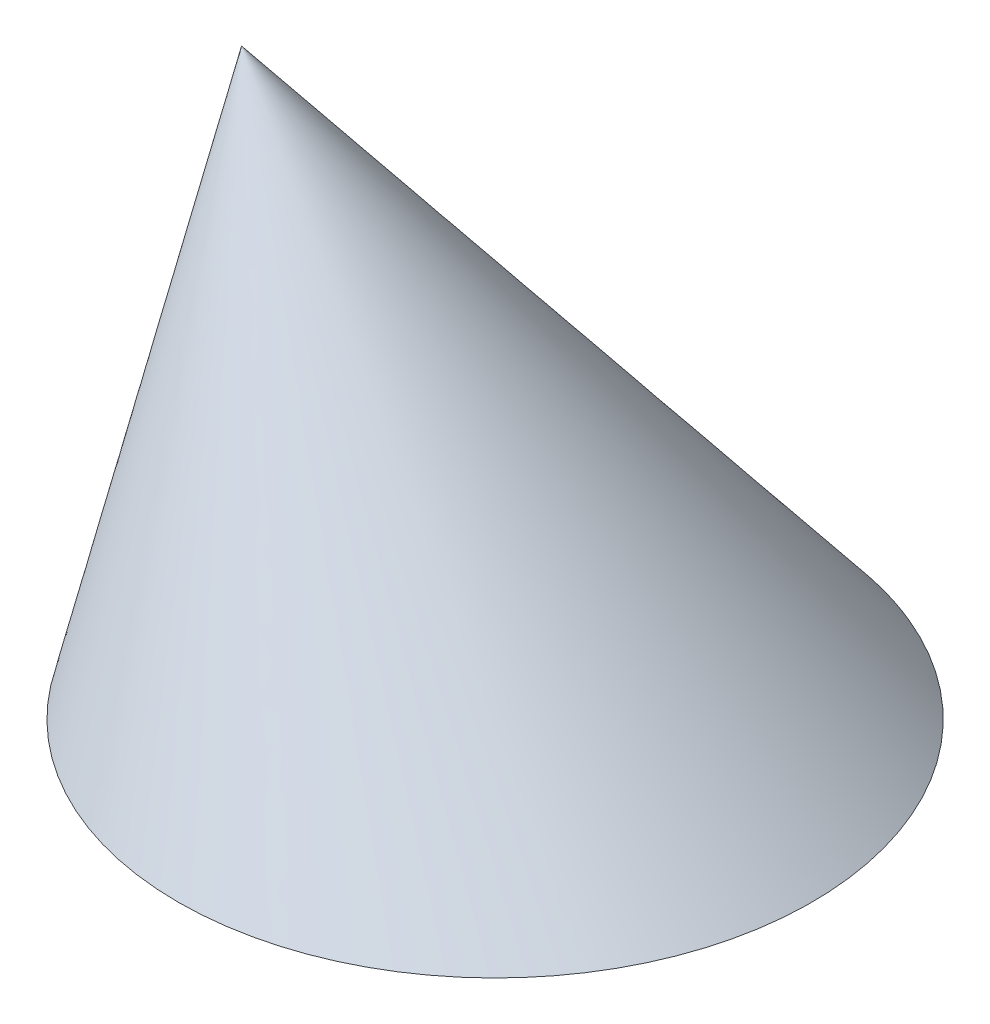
from build123d import *

# Parameters (mm, degrees)
SKETCH_1_R = 250


with BuildPart() as part:
    # Sketch 1 → Loft 1 section 0
    with BuildSketch(Plane(origin=(0, 0, 0), x_dir=(1, 0, 0), z_dir=(0, 1, 0)), mode=Mode.PRIVATE) as loft_1_s0:
        Circle(SKETCH_1_R)
    loft([loft_1_s0.sketch, Vertex(-200, 360, 0)])


solid = part.part
